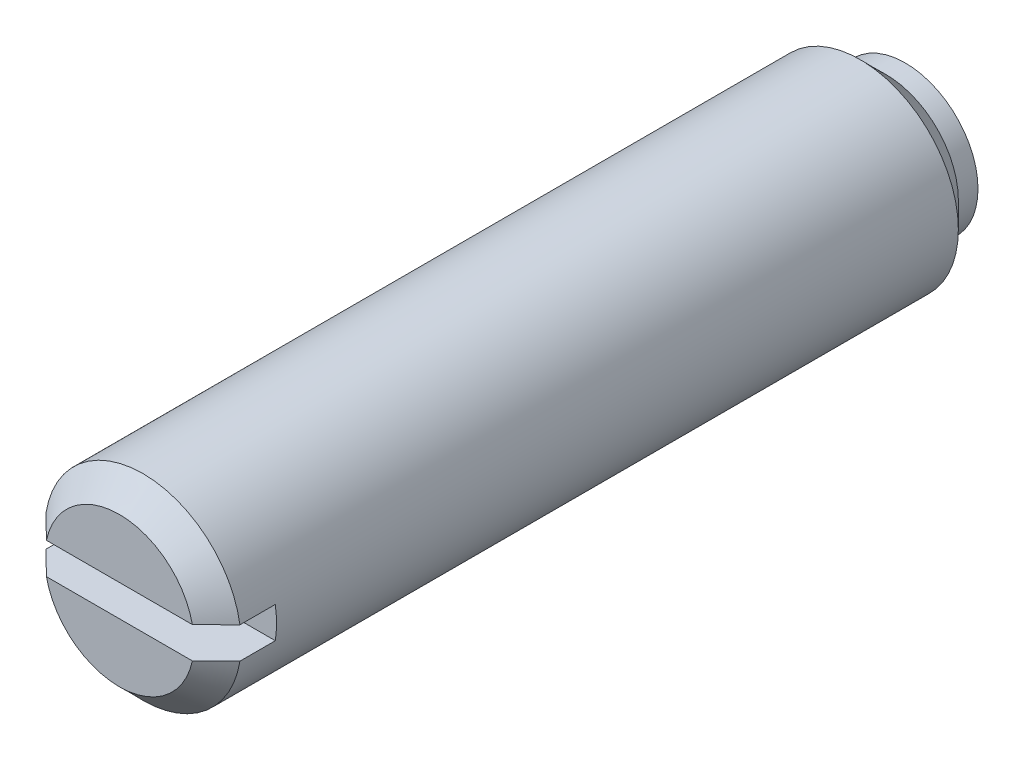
ISO-10303-21;
HEADER;
FILE_DESCRIPTION(('STEP AP214'),'2;1');
FILE_NAME('part.step','',(''),(''),'','','');
FILE_SCHEMA(('AUTOMOTIVE_DESIGN { 1 0 10303 214 1 1 1 1 }'));
ENDSEC;
DATA;
#1=APPLICATION_CONTEXT('core data for automotive mechanical design processes');
#2=APPLICATION_PROTOCOL_DEFINITION('international standard','automotive_design',2000,#1);
#3=PRODUCT_CONTEXT('',#1,'mechanical');
#4=PRODUCT('Part','Part','',(#3));
#5=PRODUCT_RELATED_PRODUCT_CATEGORY('part','',(#4));
#6=PRODUCT_DEFINITION_FORMATION('','',#4);
#7=PRODUCT_DEFINITION_CONTEXT('part definition',#1,'design');
#8=PRODUCT_DEFINITION('design','',#6,#7);
#9=PRODUCT_DEFINITION_SHAPE('','',#8);
#10=(LENGTH_UNIT() NAMED_UNIT(*) SI_UNIT(.MILLI.,.METRE.));
#11=(NAMED_UNIT(*) PLANE_ANGLE_UNIT() SI_UNIT($,.RADIAN.));
#12=(NAMED_UNIT(*) SI_UNIT($,.STERADIAN.) SOLID_ANGLE_UNIT());
#13=UNCERTAINTY_MEASURE_WITH_UNIT(LENGTH_MEASURE(1.E-05),#10,'distance_accuracy_value','');
#14=(GEOMETRIC_REPRESENTATION_CONTEXT(3) GLOBAL_UNCERTAINTY_ASSIGNED_CONTEXT((#13)) GLOBAL_UNIT_ASSIGNED_CONTEXT((#10,
#11,#12)) REPRESENTATION_CONTEXT('',''));
#15=CARTESIAN_POINT('',(0.,0.,0.));
#16=DIRECTION('',(0.,0.,1.));
#17=DIRECTION('',(1.,0.,0.));
#18=AXIS2_PLACEMENT_3D('',#15,#16,#17);
#19=CARTESIAN_POINT('',(0.,0.,0.9));
#20=DIRECTION('',(0.,0.,-1.));
#21=DIRECTION('',(-1.,0.,0.));
#22=AXIS2_PLACEMENT_3D('',#19,#20,#21);
#23=PLANE('',#22);
#24=CARTESIAN_POINT('',(0.,0.,0.9));
#25=DIRECTION('',(0.,0.,-1.));
#26=DIRECTION('',(-1.,0.,0.));
#27=AXIS2_PLACEMENT_3D('',#24,#25,#26);
#28=CIRCLE('',#27,1.37477270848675);
#29=CARTESIAN_POINT('',(-1.37477270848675,0.,0.9));
#30=VERTEX_POINT('',#29);
#31=EDGE_CURVE('E138',#30,#30,#28,.T.);
#32=ORIENTED_EDGE('',*,*,#31,.F.);
#33=EDGE_LOOP('',(#32));
#34=FACE_BOUND('',#33,.T.);
#35=CARTESIAN_POINT('',(0.,0.,0.9));
#36=DIRECTION('',(0.,0.,1.));
#37=DIRECTION('',(1.,0.,0.));
#38=AXIS2_PLACEMENT_3D('',#35,#36,#37);
#39=CIRCLE('',#38,1.85);
#40=CARTESIAN_POINT('',(1.85,0.,0.9));
#41=VERTEX_POINT('',#40);
#42=EDGE_CURVE('E174',#41,#41,#39,.T.);
#43=ORIENTED_EDGE('',*,*,#42,.F.);
#44=EDGE_LOOP('',(#43));
#45=FACE_BOUND('',#44,.T.);
#46=ADVANCED_FACE('F14',(#34,#45),#23,.T.);
#47=CARTESIAN_POINT('',(0.,0.,1.5));
#48=DIRECTION('',(0.,0.,-1.));
#49=DIRECTION('',(1.,0.,0.));
#50=AXIS2_PLACEMENT_3D('',#47,#48,#49);
#51=SPHERICAL_SURFACE('',#50,1.5);
#52=ORIENTED_EDGE('',*,*,#31,.T.);
#53=EDGE_LOOP('',(#52));
#54=FACE_BOUND('',#53,.T.);
#55=ADVANCED_FACE('F163',(#54),#51,.T.);
#56=CARTESIAN_POINT('',(0.,0.,23.721429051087));
#57=DIRECTION('',(0.,0.,1.));
#58=DIRECTION('',(1.,0.,0.));
#59=AXIS2_PLACEMENT_3D('',#56,#57,#58);
#60=CYLINDRICAL_SURFACE('',#59,1.85);
#61=ORIENTED_EDGE('',*,*,#42,.T.);
#62=EDGE_LOOP('',(#61));
#63=FACE_BOUND('',#62,.T.);
#64=CARTESIAN_POINT('',(0.,0.,1.4));
#65=DIRECTION('',(0.,0.,1.));
#66=DIRECTION('',(1.,0.,0.));
#67=AXIS2_PLACEMENT_3D('',#64,#65,#66);
#68=CIRCLE('',#67,1.85);
#69=CARTESIAN_POINT('',(1.85,0.,1.4));
#70=VERTEX_POINT('',#69);
#71=EDGE_CURVE('E176',#70,#70,#68,.T.);
#72=ORIENTED_EDGE('',*,*,#71,.F.);
#73=EDGE_LOOP('',(#72));
#74=FACE_BOUND('',#73,.T.);
#75=ADVANCED_FACE('F158',(#63,#74),#60,.T.);
#76=CARTESIAN_POINT('',(0.,0.,2.05));
#77=DIRECTION('',(0.,0.,1.));
#78=DIRECTION('',(1.,0.,0.));
#79=AXIS2_PLACEMENT_3D('',#76,#77,#78);
#80=CONICAL_SURFACE('',#79,2.5,0.785398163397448);
#81=ORIENTED_EDGE('',*,*,#71,.T.);
#82=EDGE_LOOP('',(#81));
#83=FACE_BOUND('',#82,.T.);
#84=CARTESIAN_POINT('',(0.,0.,2.05));
#85=DIRECTION('',(0.,0.,1.));
#86=DIRECTION('',(1.,0.,0.));
#87=AXIS2_PLACEMENT_3D('',#84,#85,#86);
#88=CIRCLE('',#87,2.5);
#89=CARTESIAN_POINT('',(2.5,0.,2.05));
#90=VERTEX_POINT('',#89);
#91=EDGE_CURVE('E179',#90,#90,#88,.T.);
#92=ORIENTED_EDGE('',*,*,#91,.F.);
#93=EDGE_LOOP('',(#92));
#94=FACE_BOUND('',#93,.T.);
#95=ADVANCED_FACE('F153',(#83,#94),#80,.T.);
#96=CARTESIAN_POINT('',(0.,2.5,20.9));
#97=DIRECTION('',(0.,0.,1.));
#98=DIRECTION('',(1.,0.,0.));
#99=AXIS2_PLACEMENT_3D('',#96,#97,#98);
#100=PLANE('',#99);
#101=DIRECTION('',(1.,0.,0.));
#102=VECTOR('',#101,1.);
#103=CARTESIAN_POINT('',(-2.46779253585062,-0.4,20.9));
#104=LINE('',#103,#102);
#105=CARTESIAN_POINT('',(-1.85741756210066,-0.4,20.9));
#106=VERTEX_POINT('',#105);
#107=CARTESIAN_POINT('',(1.85741756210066,-0.4,20.9));
#108=VERTEX_POINT('',#107);
#109=EDGE_CURVE('E133',#106,#108,#104,.T.);
#110=ORIENTED_EDGE('',*,*,#109,.F.);
#111=CARTESIAN_POINT('',(0.,0.,20.9));
#112=DIRECTION('',(0.,0.,1.));
#113=DIRECTION('',(1.,0.,0.));
#114=AXIS2_PLACEMENT_3D('',#111,#112,#113);
#115=CIRCLE('',#114,1.9);
#116=EDGE_CURVE('E83',#106,#108,#115,.T.);
#117=ORIENTED_EDGE('',*,*,#116,.T.);
#118=EDGE_LOOP('',(#110,#117));
#119=FACE_BOUND('',#118,.T.);
#120=ADVANCED_FACE('F115',(#119),#100,.T.);
#121=CARTESIAN_POINT('',(-2.46779253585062,-0.4,18.9));
#122=DIRECTION('',(0.,-1.,0.));
#123=DIRECTION('',(1.,0.,0.));
#124=AXIS2_PLACEMENT_3D('',#121,#122,#123);
#125=PLANE('',#124);
#126=DIRECTION('',(0.,0.,1.));
#127=VECTOR('',#126,1.);
#128=CARTESIAN_POINT('',(2.46779253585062,-0.4,18.9));
#129=LINE('',#128,#127);
#130=CARTESIAN_POINT('',(2.46779253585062,-0.4,19.4));
#131=VERTEX_POINT('',#130);
#132=CARTESIAN_POINT('',(2.46779253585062,-0.4,20.3));
#133=VERTEX_POINT('',#132);
#134=EDGE_CURVE('E135',#131,#133,#129,.T.);
#135=ORIENTED_EDGE('',*,*,#134,.F.);
#136=DIRECTION('',(1.,0.,0.));
#137=VECTOR('',#136,1.);
#138=CARTESIAN_POINT('',(-2.46779253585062,-0.4,19.4));
#139=LINE('',#138,#137);
#140=CARTESIAN_POINT('',(-2.46779253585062,-0.4,19.4));
#141=VERTEX_POINT('',#140);
#142=EDGE_CURVE('E186',#141,#131,#139,.T.);
#143=ORIENTED_EDGE('',*,*,#142,.F.);
#144=DIRECTION('',(0.,0.,1.));
#145=VECTOR('',#144,1.);
#146=CARTESIAN_POINT('',(-2.46779253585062,-0.4,18.9));
#147=LINE('',#146,#145);
#148=CARTESIAN_POINT('',(-2.46779253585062,-0.4,20.3));
#149=VERTEX_POINT('',#148);
#150=EDGE_CURVE('E132',#141,#149,#147,.T.);
#151=ORIENTED_EDGE('',*,*,#150,.T.);
#152=CARTESIAN_POINT('',(-2.46779253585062,-0.4,20.3));
#153=CARTESIAN_POINT('',(-2.41703205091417,-0.4,20.3501058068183));
#154=CARTESIAN_POINT('',(-2.36625249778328,-0.4,20.400192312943));
#155=CARTESIAN_POINT('',(-2.26464552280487,-0.4,20.5003166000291));
#156=CARTESIAN_POINT('',(-2.21381810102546,-0.4,20.5503543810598));
#157=CARTESIAN_POINT('',(-2.11210548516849,-0.4,20.650371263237));
#158=CARTESIAN_POINT('',(-2.06122029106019,-0.4,20.7003503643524));
#159=CARTESIAN_POINT('',(-1.9593771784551,-0.4,20.8002345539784));
#160=CARTESIAN_POINT('',(-1.90841925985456,-0.4,20.8501396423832));
#161=CARTESIAN_POINT('',(-1.85741756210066,-0.4,20.9));
#162=B_SPLINE_CURVE_WITH_KNOTS('',3,(#152,#153,#154,#155,#156,#157,#158,#159,#160,#161),
.UNSPECIFIED.,.F.,.F.,(4,2,2,2,4),(0.,0.213974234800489,0.427948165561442,0.64192221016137,
0.855896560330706),.UNSPECIFIED.);
#163=EDGE_CURVE('E100',#149,#106,#162,.T.);
#164=ORIENTED_EDGE('',*,*,#163,.T.);
#165=ORIENTED_EDGE('',*,*,#109,.T.);
#166=CARTESIAN_POINT('',(1.85741756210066,-0.4,20.9));
#167=CARTESIAN_POINT('',(1.90841925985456,-0.4,20.8501396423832));
#168=CARTESIAN_POINT('',(1.9593771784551,-0.4,20.8002345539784));
#169=CARTESIAN_POINT('',(2.06122029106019,-0.4,20.7003503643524));
#170=CARTESIAN_POINT('',(2.11210548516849,-0.4,20.650371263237));
#171=CARTESIAN_POINT('',(2.21381810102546,-0.4,20.5503543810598));
#172=CARTESIAN_POINT('',(2.26464552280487,-0.4,20.5003166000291));
#173=CARTESIAN_POINT('',(2.36625249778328,-0.4,20.400192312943));
#174=CARTESIAN_POINT('',(2.41703205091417,-0.4,20.3501058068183));
#175=CARTESIAN_POINT('',(2.46779253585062,-0.4,20.3));
#176=B_SPLINE_CURVE_WITH_KNOTS('',3,(#166,#167,#168,#169,#170,#171,#172,#173,#174,#175),
.UNSPECIFIED.,.F.,.F.,(4,2,2,2,4),(0.,0.213974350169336,0.427948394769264,0.641922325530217,
0.855896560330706),.UNSPECIFIED.);
#177=EDGE_CURVE('E89',#108,#133,#176,.T.);
#178=ORIENTED_EDGE('',*,*,#177,.T.);
#179=EDGE_LOOP('',(#135,#143,#151,#164,#165,#178));
#180=FACE_BOUND('',#179,.T.);
#181=ADVANCED_FACE('F109',(#180),#125,.F.);
#182=DIRECTION('',(1.,0.,0.));
#183=VECTOR('',#182,1.);
#184=CARTESIAN_POINT('',(-2.46779253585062,0.4,20.9));
#185=LINE('',#184,#183);
#186=CARTESIAN_POINT('',(-1.85741756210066,0.4,20.9));
#187=VERTEX_POINT('',#186);
#188=CARTESIAN_POINT('',(1.85741756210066,0.4,20.9));
#189=VERTEX_POINT('',#188);
#190=EDGE_CURVE('E80',#187,#189,#185,.T.);
#191=ORIENTED_EDGE('',*,*,#190,.T.);
#192=CARTESIAN_POINT('',(0.,0.,20.9));
#193=DIRECTION('',(0.,0.,1.));
#194=DIRECTION('',(1.,0.,0.));
#195=AXIS2_PLACEMENT_3D('',#192,#193,#194);
#196=CIRCLE('',#195,1.9);
#197=EDGE_CURVE('E9',#189,#187,#196,.T.);
#198=ORIENTED_EDGE('',*,*,#197,.T.);
#199=EDGE_LOOP('',(#191,#198));
#200=FACE_BOUND('',#199,.T.);
#201=ADVANCED_FACE('F114',(#200),#100,.T.);
#202=CARTESIAN_POINT('',(-2.46779253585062,0.4,18.9));
#203=DIRECTION('',(0.,-1.,0.));
#204=DIRECTION('',(1.,0.,0.));
#205=AXIS2_PLACEMENT_3D('',#202,#203,#204);
#206=PLANE('',#205);
#207=DIRECTION('',(-1.,0.,0.));
#208=VECTOR('',#207,1.);
#209=CARTESIAN_POINT('',(2.46779253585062,0.4,19.4));
#210=LINE('',#209,#208);
#211=CARTESIAN_POINT('',(2.46779253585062,0.4,19.4));
#212=VERTEX_POINT('',#211);
#213=CARTESIAN_POINT('',(-2.46779253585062,0.4,19.4));
#214=VERTEX_POINT('',#213);
#215=EDGE_CURVE('E30',#212,#214,#210,.T.);
#216=ORIENTED_EDGE('',*,*,#215,.F.);
#217=DIRECTION('',(0.,0.,1.));
#218=VECTOR('',#217,1.);
#219=CARTESIAN_POINT('',(2.46779253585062,0.4,18.9));
#220=LINE('',#219,#218);
#221=CARTESIAN_POINT('',(2.46779253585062,0.4,20.3));
#222=VERTEX_POINT('',#221);
#223=EDGE_CURVE('E73',#212,#222,#220,.T.);
#224=ORIENTED_EDGE('',*,*,#223,.T.);
#225=CARTESIAN_POINT('',(2.46779253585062,0.4,20.3));
#226=CARTESIAN_POINT('',(2.41703205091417,0.4,20.3501058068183));
#227=CARTESIAN_POINT('',(2.36625249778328,0.4,20.400192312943));
#228=CARTESIAN_POINT('',(2.26464552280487,0.4,20.5003166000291));
#229=CARTESIAN_POINT('',(2.21381810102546,0.4,20.5503543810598));
#230=CARTESIAN_POINT('',(2.11210548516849,0.4,20.650371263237));
#231=CARTESIAN_POINT('',(2.06122029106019,0.4,20.7003503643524));
#232=CARTESIAN_POINT('',(1.9593771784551,0.4,20.8002345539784));
#233=CARTESIAN_POINT('',(1.90841925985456,0.4,20.8501396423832));
#234=CARTESIAN_POINT('',(1.85741756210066,0.4,20.9));
#235=B_SPLINE_CURVE_WITH_KNOTS('',3,(#225,#226,#227,#228,#229,#230,#231,#232,#233,#234),
.UNSPECIFIED.,.F.,.F.,(4,2,2,2,4),(0.,0.213974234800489,0.427948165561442,0.64192221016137,
0.855896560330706),.UNSPECIFIED.);
#236=EDGE_CURVE('E23',#222,#189,#235,.T.);
#237=ORIENTED_EDGE('',*,*,#236,.T.);
#238=ORIENTED_EDGE('',*,*,#190,.F.);
#239=CARTESIAN_POINT('',(-1.85741756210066,0.4,20.9));
#240=CARTESIAN_POINT('',(-1.90841925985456,0.4,20.8501396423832));
#241=CARTESIAN_POINT('',(-1.9593771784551,0.4,20.8002345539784));
#242=CARTESIAN_POINT('',(-2.06122029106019,0.4,20.7003503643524));
#243=CARTESIAN_POINT('',(-2.11210548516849,0.4,20.650371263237));
#244=CARTESIAN_POINT('',(-2.21381810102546,0.4,20.5503543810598));
#245=CARTESIAN_POINT('',(-2.26464552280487,0.4,20.5003166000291));
#246=CARTESIAN_POINT('',(-2.36625249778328,0.4,20.400192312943));
#247=CARTESIAN_POINT('',(-2.41703205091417,0.4,20.3501058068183));
#248=CARTESIAN_POINT('',(-2.46779253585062,0.4,20.3));
#249=B_SPLINE_CURVE_WITH_KNOTS('',3,(#239,#240,#241,#242,#243,#244,#245,#246,#247,#248),
.UNSPECIFIED.,.F.,.F.,(4,2,2,2,4),(0.,0.213974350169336,0.427948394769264,0.641922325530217,
0.855896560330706),.UNSPECIFIED.);
#250=CARTESIAN_POINT('',(-2.46779253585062,0.4,20.3));
#251=VERTEX_POINT('',#250);
#252=EDGE_CURVE('E77',#187,#251,#249,.T.);
#253=ORIENTED_EDGE('',*,*,#252,.T.);
#254=DIRECTION('',(0.,0.,1.));
#255=VECTOR('',#254,1.);
#256=CARTESIAN_POINT('',(-2.46779253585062,0.4,18.9));
#257=LINE('',#256,#255);
#258=EDGE_CURVE('E35',#214,#251,#257,.T.);
#259=ORIENTED_EDGE('',*,*,#258,.F.);
#260=EDGE_LOOP('',(#216,#224,#237,#238,#253,#259));
#261=FACE_BOUND('',#260,.T.);
#262=ADVANCED_FACE('F78',(#261),#206,.T.);
#263=CARTESIAN_POINT('',(0.,0.,0.9));
#264=DIRECTION('',(0.,0.,-1.));
#265=DIRECTION('',(-1.,0.,0.));
#266=AXIS2_PLACEMENT_3D('',#263,#264,#265);
#267=CYLINDRICAL_SURFACE('',#266,2.5);
#268=CARTESIAN_POINT('',(0.,0.,19.4));
#269=DIRECTION('',(0.,0.,1.));
#270=DIRECTION('',(1.,0.,0.));
#271=AXIS2_PLACEMENT_3D('',#268,#269,#270);
#272=CIRCLE('',#271,2.5);
#273=EDGE_CURVE('E144',#131,#212,#272,.T.);
#274=ORIENTED_EDGE('',*,*,#273,.F.);
#275=ORIENTED_EDGE('',*,*,#134,.T.);
#276=CARTESIAN_POINT('',(0.,0.,20.3));
#277=DIRECTION('',(0.,0.,1.));
#278=DIRECTION('',(1.,0.,0.));
#279=AXIS2_PLACEMENT_3D('',#276,#277,#278);
#280=CIRCLE('',#279,2.5);
#281=EDGE_CURVE('E86',#133,#149,#280,.F.);
#282=ORIENTED_EDGE('',*,*,#281,.T.);
#283=ORIENTED_EDGE('',*,*,#150,.F.);
#284=CARTESIAN_POINT('',(0.,0.,19.4));
#285=DIRECTION('',(0.,0.,1.));
#286=DIRECTION('',(1.,0.,0.));
#287=AXIS2_PLACEMENT_3D('',#284,#285,#286);
#288=CIRCLE('',#287,2.5);
#289=EDGE_CURVE('E72',#214,#141,#288,.T.);
#290=ORIENTED_EDGE('',*,*,#289,.F.);
#291=ORIENTED_EDGE('',*,*,#258,.T.);
#292=CARTESIAN_POINT('',(0.,0.,20.3));
#293=DIRECTION('',(0.,0.,1.));
#294=DIRECTION('',(1.,0.,0.));
#295=AXIS2_PLACEMENT_3D('',#292,#293,#294);
#296=CIRCLE('',#295,2.5);
#297=EDGE_CURVE('E69',#251,#222,#296,.F.);
#298=ORIENTED_EDGE('',*,*,#297,.T.);
#299=ORIENTED_EDGE('',*,*,#223,.F.);
#300=EDGE_LOOP('',(#274,#275,#282,#283,#290,#291,#298,#299));
#301=FACE_BOUND('',#300,.T.);
#302=ORIENTED_EDGE('',*,*,#91,.T.);
#303=EDGE_LOOP('',(#302));
#304=FACE_BOUND('',#303,.T.);
#305=ADVANCED_FACE('F66',(#301,#304),#267,.T.);
#306=CARTESIAN_POINT('',(0.,0.,20.3));
#307=DIRECTION('',(0.,0.,-1.));
#308=DIRECTION('',(-1.,0.,0.));
#309=AXIS2_PLACEMENT_3D('',#306,#307,#308);
#310=CONICAL_SURFACE('',#309,2.5,0.785398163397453);
#311=ORIENTED_EDGE('',*,*,#177,.F.);
#312=ORIENTED_EDGE('',*,*,#116,.F.);
#313=ORIENTED_EDGE('',*,*,#163,.F.);
#314=ORIENTED_EDGE('',*,*,#281,.F.);
#315=EDGE_LOOP('',(#311,#312,#313,#314));
#316=FACE_BOUND('',#315,.T.);
#317=ADVANCED_FACE('F106',(#316),#310,.T.);
#318=CARTESIAN_POINT('',(0.,0.,20.3));
#319=DIRECTION('',(0.,0.,-1.));
#320=DIRECTION('',(-1.,0.,0.));
#321=AXIS2_PLACEMENT_3D('',#318,#319,#320);
#322=CONICAL_SURFACE('',#321,2.5,0.785398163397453);
#323=ORIENTED_EDGE('',*,*,#252,.F.);
#324=ORIENTED_EDGE('',*,*,#197,.F.);
#325=ORIENTED_EDGE('',*,*,#236,.F.);
#326=ORIENTED_EDGE('',*,*,#297,.F.);
#327=EDGE_LOOP('',(#323,#324,#325,#326));
#328=FACE_BOUND('',#327,.T.);
#329=ADVANCED_FACE('F16',(#328),#322,.T.);
#330=CARTESIAN_POINT('',(0.,0.,19.4));
#331=DIRECTION('',(0.,0.,1.));
#332=DIRECTION('',(1.,0.,0.));
#333=AXIS2_PLACEMENT_3D('',#330,#331,#332);
#334=PLANE('',#333);
#335=ORIENTED_EDGE('',*,*,#289,.T.);
#336=ORIENTED_EDGE('',*,*,#142,.T.);
#337=ORIENTED_EDGE('',*,*,#273,.T.);
#338=ORIENTED_EDGE('',*,*,#215,.T.);
#339=EDGE_LOOP('',(#335,#336,#337,#338));
#340=FACE_BOUND('',#339,.T.);
#341=ADVANCED_FACE('F189',(#340),#334,.T.);
#342=CLOSED_SHELL('',(#46,#55,#75,#95,#120,#181,#201,#262,#305,#317,#329,#341));
#343=MANIFOLD_SOLID_BREP('B1',#342);
#344=ADVANCED_BREP_SHAPE_REPRESENTATION('',(#18,#343),#14);
#345=SHAPE_DEFINITION_REPRESENTATION(#9,#344);
ENDSEC;
END-ISO-10303-21;
